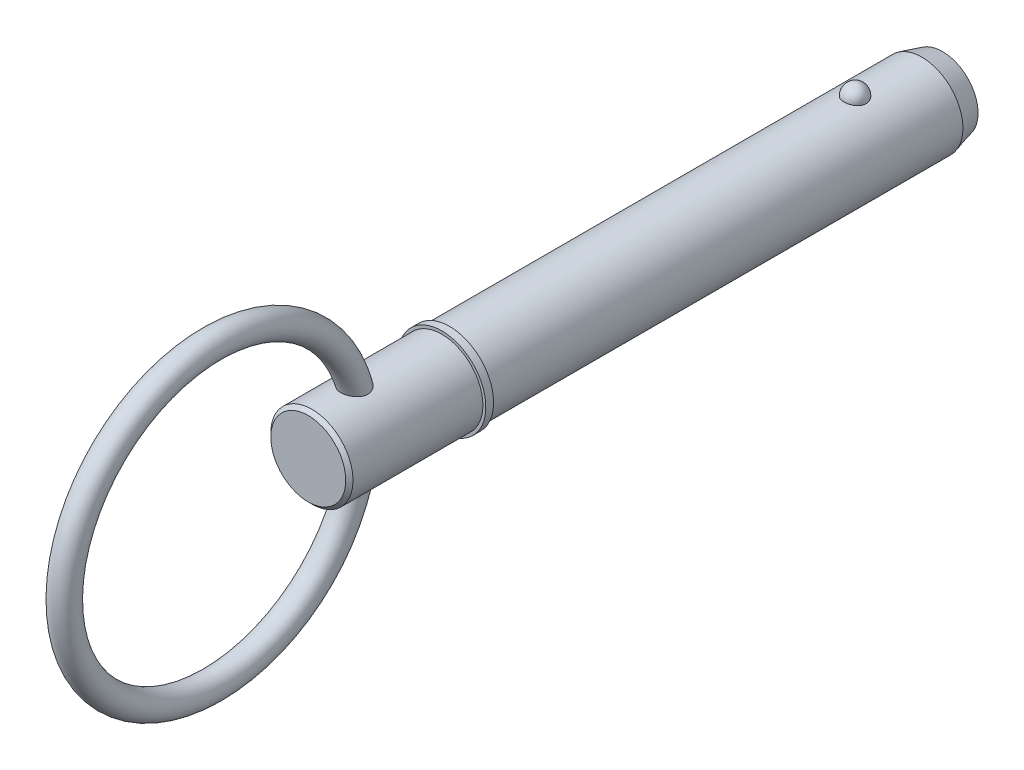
from build123d import *

# Parameters (mm, degrees)
SKETCH2_R           = 7.94
BOSS_EXTRUDE1_DEPTH = 76.2
BOSS_EXTRUDE2_START = 19.05
SKETCH3_R           = 7.94
BOSS_EXTRUDE2_DEPTH = 19.05
CHAMFER1_SIZE       = 4
CHAMFER1_SIZE2      = 1.07179677
SKETCH20_W          = 1.5
SKETCH20_H          = 8.5
SKETCH21_R          = 7.94
BOSS_EXTRUDE3_DEPTH = 27.31
CHAMFER2_SIZE       = 0.7
SKETCH24_R          = 2.5


with BuildPart() as part:
    # Sketch2 → Boss-Extrude1 (new body)
    with BuildSketch(Plane.XY):
        with Locations(Location((0, 0, 0), (0, 0, 180))):
            Circle(SKETCH2_R)
    extrude(amount=BOSS_EXTRUDE1_DEPTH)

    # Sketch3 → Boss-Extrude2 (add)
    with BuildSketch(Plane(origin=(0, 0, 0), x_dir=(-1, 0, 0), z_dir=(0, 0, -1)).offset(BOSS_EXTRUDE2_START)):
        Circle(SKETCH3_R)
    extrude(amount=-BOSS_EXTRUDE2_DEPTH)

    # Chamfer1
    chamfer1_edges = [part.edges().sort_by_distance(p)[0] for p in [
        (7.94, 0, -19.05),
    ]]
    chamfer1_side = [part.faces().sort_by_distance(p)[0] for p in [
        (7.94, 0, 28.575),
    ]]
    chamfer(chamfer1_edges, length=CHAMFER1_SIZE, length2=CHAMFER1_SIZE2, reference=chamfer1_side[0])

    # Sketch18 → Revolve1 (revolve)
    with BuildSketch(Plane(origin=(0, 0, 0), x_dir=(0, 0, -1), z_dir=(1, 0, 0))):
        with BuildLine():
            Line((2.15, 10.09), (2.15, 5.79))
            ThreePointArc((2.15, 5.79), (0, 7.94), (2.15, 10.09))
        make_face()
    revolve(axis=Axis((0, 10.09, -2.15), (0, -1, 0)))

    # Sketch20 → Revolve2 (revolve)
    with BuildSketch(Plane(origin=(0, 0, 0), x_dir=(0, 0, -1), z_dir=(1, 0, 0)), mode=Mode.PRIVATE) as revolve2_sk:
        with Locations((-76.95, 4.25)):
            Rectangle(SKETCH20_W, SKETCH20_H)
    revolve(revolve2_sk.sketch.rotate(Axis((0, 0, 33.728787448), (0, 0, 1)), 90), axis=Axis((0, 0, 33.728787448), (0, 0, 1)))

    # Sketch21 → Boss-Extrude3 (add)
    with BuildSketch(Plane(origin=(0, 0, 76.2), x_dir=(-1, 0, 0), z_dir=(0, 0, -1))):
        Circle(SKETCH21_R)
    extrude(amount=-BOSS_EXTRUDE3_DEPTH)

    # Chamfer2
    chamfer2_edges = [part.edges().sort_by_distance(p)[0] for p in [
        (7.94, 0, 103.51),
    ]]
    chamfer(chamfer2_edges, length=CHAMFER2_SIZE)

    # Sweep1: sweep along a path in Sketch23
    with BuildLine(Plane(origin=(0, 0, 0), x_dir=(0, 0, -1), z_dir=(1, 0, 0))) as sweep1_path:
        CenterArc((-122.085, 0), 28.575, 0, 360)
    # Sketch24 → Sweep1 (sweep)
    with BuildSketch(Plane(origin=(0, 0, 0), x_dir=(1, 0, 0), z_dir=(0, 1, 0))):
        with Locations((0, -93.51)):
            Circle(SKETCH24_R)
    sweep(path=sweep1_path.line)


solid = part.part
